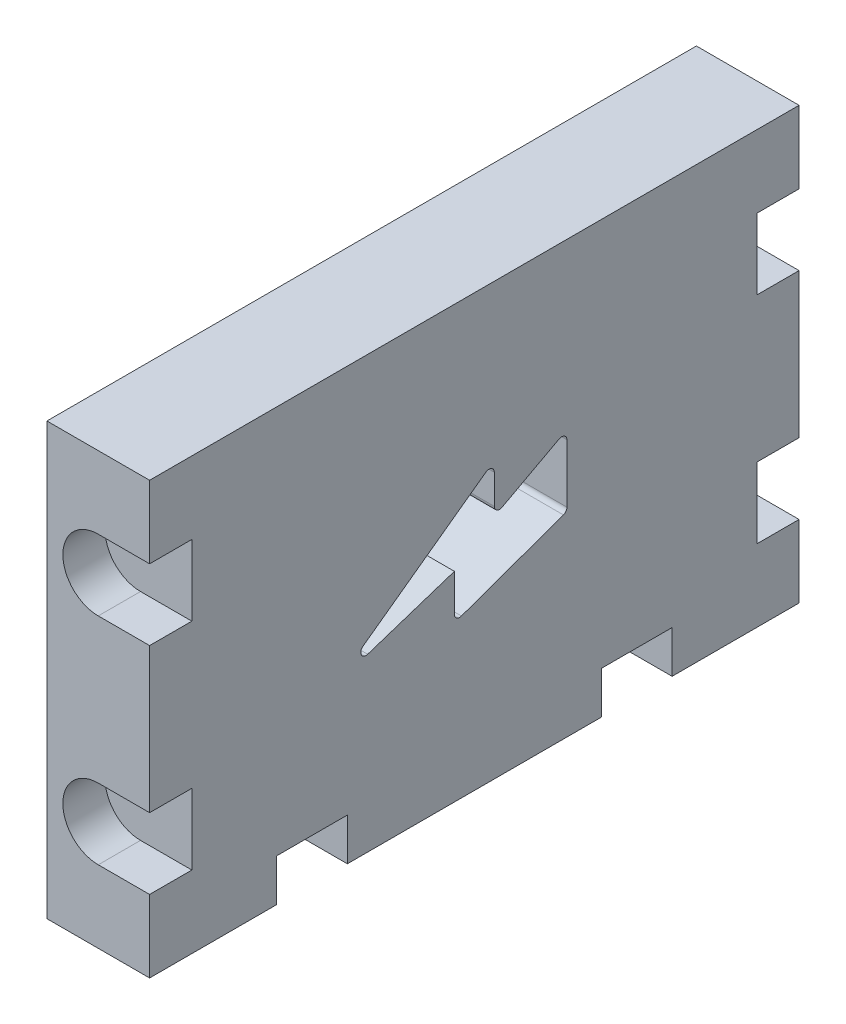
ISO-10303-21;
HEADER;
FILE_DESCRIPTION(('STEP AP214'),'2;1');
FILE_NAME('part.step','',(''),(''),'','','');
FILE_SCHEMA(('AUTOMOTIVE_DESIGN { 1 0 10303 214 1 1 1 1 }'));
ENDSEC;
DATA;
#1=APPLICATION_CONTEXT('core data for automotive mechanical design processes');
#2=APPLICATION_PROTOCOL_DEFINITION('international standard','automotive_design',2000,#1);
#3=PRODUCT_CONTEXT('',#1,'mechanical');
#4=PRODUCT('Part','Part','',(#3));
#5=PRODUCT_RELATED_PRODUCT_CATEGORY('part','',(#4));
#6=PRODUCT_DEFINITION_FORMATION('','',#4);
#7=PRODUCT_DEFINITION_CONTEXT('part definition',#1,'design');
#8=PRODUCT_DEFINITION('design','',#6,#7);
#9=PRODUCT_DEFINITION_SHAPE('','',#8);
#10=(LENGTH_UNIT() NAMED_UNIT(*) SI_UNIT(.MILLI.,.METRE.));
#11=(NAMED_UNIT(*) PLANE_ANGLE_UNIT() SI_UNIT($,.RADIAN.));
#12=(NAMED_UNIT(*) SI_UNIT($,.STERADIAN.) SOLID_ANGLE_UNIT());
#13=UNCERTAINTY_MEASURE_WITH_UNIT(LENGTH_MEASURE(1.E-05),#10,'distance_accuracy_value','');
#14=(GEOMETRIC_REPRESENTATION_CONTEXT(3) GLOBAL_UNCERTAINTY_ASSIGNED_CONTEXT((#13)) GLOBAL_UNIT_ASSIGNED_CONTEXT((#10,
#11,#12)) REPRESENTATION_CONTEXT('',''));
#15=CARTESIAN_POINT('',(0.,0.,0.));
#16=DIRECTION('',(0.,0.,1.));
#17=DIRECTION('',(1.,0.,0.));
#18=AXIS2_PLACEMENT_3D('',#15,#16,#17);
#19=CARTESIAN_POINT('',(-821.069349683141,484.071769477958,0.));
#20=DIRECTION('',(1.,0.,0.));
#21=DIRECTION('',(0.,0.,-1.));
#22=AXIS2_PLACEMENT_3D('',#19,#20,#21);
#23=PLANE('',#22);
#24=DIRECTION('',(0.,-1.,0.));
#25=VECTOR('',#24,1.);
#26=CARTESIAN_POINT('',(-821.069349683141,594.273586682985,-41.4368102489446));
#27=LINE('',#26,#25);
#28=CARTESIAN_POINT('',(-821.069349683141,593.027616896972,-41.4368102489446));
#29=VERTEX_POINT('',#28);
#30=CARTESIAN_POINT('',(-821.069349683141,589.475600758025,-41.4368102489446));
#31=VERTEX_POINT('',#30);
#32=EDGE_CURVE('E428',#29,#31,#27,.T.);
#33=ORIENTED_EDGE('',*,*,#32,.T.);
#34=CARTESIAN_POINT('',(-821.069349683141,589.475600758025,-42.0718102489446));
#35=DIRECTION('',(1.,0.,0.));
#36=DIRECTION('',(0.,0.,-1.));
#37=AXIS2_PLACEMENT_3D('',#34,#35,#36);
#38=CIRCLE('',#37,0.635);
#39=CARTESIAN_POINT('',(-821.069349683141,588.916063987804,-42.3720494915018));
#40=VERTEX_POINT('',#39);
#41=EDGE_CURVE('E501',#31,#40,#38,.T.);
#42=ORIENTED_EDGE('',*,*,#41,.T.);
#43=DIRECTION('',(0.,0.472817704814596,-0.881160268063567));
#44=VECTOR('',#43,1.);
#45=CARTESIAN_POINT('',(-821.069349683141,588.414228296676,-41.4368102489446));
#46=LINE('',#45,#44);
#47=CARTESIAN_POINT('',(-821.069349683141,592.599879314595,-49.2373416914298));
#48=VERTEX_POINT('',#47);
#49=EDGE_CURVE('E412',#40,#48,#46,.T.);
#50=ORIENTED_EDGE('',*,*,#49,.T.);
#51=CARTESIAN_POINT('',(-821.069349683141,592.040342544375,-49.5375809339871));
#52=DIRECTION('',(1.,0.,0.));
#53=DIRECTION('',(0.,0.,-1.));
#54=AXIS2_PLACEMENT_3D('',#51,#52,#53);
#55=CIRCLE('',#54,0.635);
#56=CARTESIAN_POINT('',(-821.069349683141,592.040342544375,-50.172580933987));
#57=VERTEX_POINT('',#56);
#58=EDGE_CURVE('E523',#48,#57,#55,.F.);
#59=ORIENTED_EDGE('',*,*,#58,.T.);
#60=DIRECTION('',(0.,-1.,0.));
#61=VECTOR('',#60,1.);
#62=CARTESIAN_POINT('',(-821.069349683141,593.101715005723,-50.172580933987));
#63=LINE('',#62,#61);
#64=CARTESIAN_POINT('',(-821.069349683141,585.026034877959,-50.172580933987));
#65=VERTEX_POINT('',#64);
#66=EDGE_CURVE('E415',#57,#65,#63,.T.);
#67=ORIENTED_EDGE('',*,*,#66,.T.);
#68=CARTESIAN_POINT('',(-821.069349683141,585.026034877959,-49.5375809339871));
#69=DIRECTION('',(1.,0.,0.));
#70=DIRECTION('',(0.,0.,-1.));
#71=AXIS2_PLACEMENT_3D('',#68,#69,#70);
#72=CIRCLE('',#71,0.635);
#73=CARTESIAN_POINT('',(-821.069349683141,584.42824204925,-49.7517508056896));
#74=VERTEX_POINT('',#73);
#75=EDGE_CURVE('E527',#65,#74,#72,.F.);
#76=ORIENTED_EDGE('',*,*,#75,.T.);
#77=DIRECTION('',(0.,-0.337275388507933,0.941406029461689));
#78=VECTOR('',#77,1.);
#79=CARTESIAN_POINT('',(-821.069349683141,584.579011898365,-50.172580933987));
#80=LINE('',#79,#78);
#81=CARTESIAN_POINT('',(-821.069349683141,580.03595465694,-37.4919596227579));
#82=VERTEX_POINT('',#81);
#83=EDGE_CURVE('E419',#74,#82,#80,.T.);
#84=ORIENTED_EDGE('',*,*,#83,.T.);
#85=CARTESIAN_POINT('',(-821.069349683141,580.633747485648,-37.2777897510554));
#86=DIRECTION('',(1.,0.,0.));
#87=DIRECTION('',(0.,0.,-1.));
#88=AXIS2_PLACEMENT_3D('',#85,#86,#87);
#89=CIRCLE('',#88,0.635);
#90=CARTESIAN_POINT('',(-821.069349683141,580.633747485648,-36.6427897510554));
#91=VERTEX_POINT('',#90);
#92=EDGE_CURVE('E114',#82,#91,#89,.F.);
#93=ORIENTED_EDGE('',*,*,#92,.T.);
#94=DIRECTION('',(0.,1.,0.));
#95=VECTOR('',#94,1.);
#96=CARTESIAN_POINT('',(-821.069349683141,579.731724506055,-36.6427897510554));
#97=LINE('',#96,#95);
#98=CARTESIAN_POINT('',(-821.069349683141,585.111680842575,-36.6427897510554));
#99=VERTEX_POINT('',#98);
#100=EDGE_CURVE('E421',#91,#99,#97,.T.);
#101=ORIENTED_EDGE('',*,*,#100,.T.);
#102=DIRECTION('',(0.,-0.31197044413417,0.950091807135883));
#103=VECTOR('',#102,1.);
#104=CARTESIAN_POINT('',(-821.069349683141,585.111680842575,-36.6427897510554));
#105=LINE('',#104,#103);
#106=CARTESIAN_POINT('',(-821.069349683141,581.688428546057,-26.217430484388));
#107=VERTEX_POINT('',#106);
#108=EDGE_CURVE('E423',#99,#107,#105,.T.);
#109=ORIENTED_EDGE('',*,*,#108,.T.);
#110=CARTESIAN_POINT('',(-821.069349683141,582.291736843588,-26.0193292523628));
#111=DIRECTION('',(1.,0.,0.));
#112=DIRECTION('',(0.,0.,-1.));
#113=AXIS2_PLACEMENT_3D('',#110,#111,#112);
#114=CIRCLE('',#113,0.635);
#115=CARTESIAN_POINT('',(-821.069349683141,582.805532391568,-25.6461816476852));
#116=VERTEX_POINT('',#115);
#117=EDGE_CURVE('E12',#107,#116,#114,.F.);
#118=ORIENTED_EDGE('',*,*,#117,.T.);
#119=DIRECTION('',(0.,0.587634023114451,-0.80912684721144));
#120=VECTOR('',#119,1.);
#121=CARTESIAN_POINT('',(-821.069349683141,580.424194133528,-22.3672620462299));
#122=LINE('',#121,#120);
#123=CARTESIAN_POINT('',(-821.069349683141,593.541412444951,-40.4286626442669));
#124=VERTEX_POINT('',#123);
#125=EDGE_CURVE('E425',#116,#124,#122,.T.);
#126=ORIENTED_EDGE('',*,*,#125,.T.);
#127=CARTESIAN_POINT('',(-821.069349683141,593.027616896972,-40.8018102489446));
#128=DIRECTION('',(1.,0.,0.));
#129=DIRECTION('',(0.,0.,-1.));
#130=AXIS2_PLACEMENT_3D('',#127,#128,#129);
#131=CIRCLE('',#130,0.635);
#132=EDGE_CURVE('E519',#124,#29,#131,.F.);
#133=ORIENTED_EDGE('',*,*,#132,.T.);
#134=EDGE_LOOP('',(#33,#42,#50,#59,#67,#76,#84,#93,#101,#109,#118,#126,#133));
#135=FACE_BOUND('',#134,.T.);
#136=DIRECTION('',(0.,-1.,0.));
#137=VECTOR('',#136,1.);
#138=CARTESIAN_POINT('',(-821.069349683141,484.071769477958,0.));
#139=LINE('',#138,#137);
#140=CARTESIAN_POINT('',(-821.069349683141,612.913454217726,0.));
#141=VERTEX_POINT('',#140);
#142=CARTESIAN_POINT('',(-821.069349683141,604.212554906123,0.));
#143=VERTEX_POINT('',#142);
#144=EDGE_CURVE('E481',#141,#143,#139,.T.);
#145=ORIENTED_EDGE('',*,*,#144,.T.);
#146=DIRECTION('',(0.,0.,1.));
#147=VECTOR('',#146,1.);
#148=CARTESIAN_POINT('',(-821.069349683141,604.212554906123,-15.5918568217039));
#149=LINE('',#148,#147);
#150=CARTESIAN_POINT('',(-821.069349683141,604.212554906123,-5.08));
#151=VERTEX_POINT('',#150);
#152=EDGE_CURVE('E361',#151,#143,#149,.T.);
#153=ORIENTED_EDGE('',*,*,#152,.F.);
#154=DIRECTION('',(0.,-1.,0.));
#155=VECTOR('',#154,1.);
#156=CARTESIAN_POINT('',(-821.069349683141,0.,-5.08));
#157=LINE('',#156,#155);
#158=CARTESIAN_POINT('',(-821.069349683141,595.703554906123,-5.08));
#159=VERTEX_POINT('',#158);
#160=EDGE_CURVE('E1234',#151,#159,#157,.T.);
#161=ORIENTED_EDGE('',*,*,#160,.T.);
#162=DIRECTION('',(0.,0.,1.));
#163=VECTOR('',#162,1.);
#164=CARTESIAN_POINT('',(-821.069349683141,595.703554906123,-15.5918568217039));
#165=LINE('',#164,#163);
#166=CARTESIAN_POINT('',(-821.069349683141,595.703554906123,0.));
#167=VERTEX_POINT('',#166);
#168=EDGE_CURVE('E1221',#159,#167,#165,.T.);
#169=ORIENTED_EDGE('',*,*,#168,.T.);
#170=CARTESIAN_POINT('',(-821.069349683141,578.301756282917,0.));
#171=VERTEX_POINT('',#170);
#172=EDGE_CURVE('E484',#167,#171,#139,.T.);
#173=ORIENTED_EDGE('',*,*,#172,.T.);
#174=DIRECTION('',(0.,0.,1.));
#175=VECTOR('',#174,1.);
#176=CARTESIAN_POINT('',(-821.069349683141,578.301756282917,-15.5918568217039));
#177=LINE('',#176,#175);
#178=CARTESIAN_POINT('',(-821.069349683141,578.301756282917,-5.08));
#179=VERTEX_POINT('',#178);
#180=EDGE_CURVE('E1140',#179,#171,#177,.T.);
#181=ORIENTED_EDGE('',*,*,#180,.F.);
#182=DIRECTION('',(0.,-1.,0.));
#183=VECTOR('',#182,1.);
#184=CARTESIAN_POINT('',(-821.069349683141,0.,-5.08));
#185=LINE('',#184,#183);
#186=CARTESIAN_POINT('',(-821.069349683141,569.792756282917,-5.08));
#187=VERTEX_POINT('',#186);
#188=EDGE_CURVE('E1222',#179,#187,#185,.T.);
#189=ORIENTED_EDGE('',*,*,#188,.T.);
#190=DIRECTION('',(0.,0.,1.));
#191=VECTOR('',#190,1.);
#192=CARTESIAN_POINT('',(-821.069349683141,569.792756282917,-15.5918568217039));
#193=LINE('',#192,#191);
#194=CARTESIAN_POINT('',(-821.069349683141,569.792756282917,0.));
#195=VERTEX_POINT('',#194);
#196=EDGE_CURVE('E1136',#187,#195,#193,.T.);
#197=ORIENTED_EDGE('',*,*,#196,.T.);
#198=CARTESIAN_POINT('',(-821.069349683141,561.091856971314,0.));
#199=VERTEX_POINT('',#198);
#200=EDGE_CURVE('E479',#195,#199,#139,.T.);
#201=ORIENTED_EDGE('',*,*,#200,.T.);
#202=DIRECTION('',(0.,0.,1.));
#203=VECTOR('',#202,1.);
#204=CARTESIAN_POINT('',(-821.069349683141,561.091856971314,0.));
#205=LINE('',#204,#203);
#206=CARTESIAN_POINT('',(-821.069349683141,561.091856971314,-15.2653999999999));
#207=VERTEX_POINT('',#206);
#208=EDGE_CURVE('E456',#207,#199,#205,.T.);
#209=ORIENTED_EDGE('',*,*,#208,.F.);
#210=DIRECTION('',(0.,-1.,0.));
#211=VECTOR('',#210,1.);
#212=CARTESIAN_POINT('',(-821.069349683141,576.683713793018,-15.2653999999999));
#213=LINE('',#212,#211);
#214=CARTESIAN_POINT('',(-821.069349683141,566.171856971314,-15.2653999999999));
#215=VERTEX_POINT('',#214);
#216=EDGE_CURVE('E1151',#215,#207,#213,.T.);
#217=ORIENTED_EDGE('',*,*,#216,.F.);
#218=DIRECTION('',(0.,0.,-1.));
#219=VECTOR('',#218,1.);
#220=CARTESIAN_POINT('',(-821.069349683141,566.171856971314,0.));
#221=LINE('',#220,#219);
#222=CARTESIAN_POINT('',(-821.069349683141,566.171856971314,-23.7744000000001));
#223=VERTEX_POINT('',#222);
#224=EDGE_CURVE('E1150',#215,#223,#221,.T.);
#225=ORIENTED_EDGE('',*,*,#224,.T.);
#226=DIRECTION('',(0.,-1.,0.));
#227=VECTOR('',#226,1.);
#228=CARTESIAN_POINT('',(-821.069349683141,576.683713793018,-23.7744000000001));
#229=LINE('',#228,#227);
#230=CARTESIAN_POINT('',(-821.069349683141,561.091856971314,-23.7744000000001));
#231=VERTEX_POINT('',#230);
#232=EDGE_CURVE('E1164',#223,#231,#229,.T.);
#233=ORIENTED_EDGE('',*,*,#232,.T.);
#234=CARTESIAN_POINT('',(-821.069349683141,561.091856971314,-54.3051999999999));
#235=VERTEX_POINT('',#234);
#236=EDGE_CURVE('E461',#235,#231,#205,.T.);
#237=ORIENTED_EDGE('',*,*,#236,.F.);
#238=DIRECTION('',(0.,-1.,0.));
#239=VECTOR('',#238,1.);
#240=CARTESIAN_POINT('',(-821.069349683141,576.683713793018,-54.3051999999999));
#241=LINE('',#240,#239);
#242=CARTESIAN_POINT('',(-821.069349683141,566.171856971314,-54.3051999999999));
#243=VERTEX_POINT('',#242);
#244=EDGE_CURVE('E1174',#243,#235,#241,.T.);
#245=ORIENTED_EDGE('',*,*,#244,.F.);
#246=DIRECTION('',(0.,0.,-1.));
#247=VECTOR('',#246,1.);
#248=CARTESIAN_POINT('',(-821.069349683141,566.171856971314,0.));
#249=LINE('',#248,#247);
#250=CARTESIAN_POINT('',(-821.069349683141,566.171856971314,-62.8142000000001));
#251=VERTEX_POINT('',#250);
#252=EDGE_CURVE('E1173',#243,#251,#249,.T.);
#253=ORIENTED_EDGE('',*,*,#252,.T.);
#254=DIRECTION('',(0.,-1.,0.));
#255=VECTOR('',#254,1.);
#256=CARTESIAN_POINT('',(-821.069349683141,576.683713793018,-62.8142000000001));
#257=LINE('',#256,#255);
#258=CARTESIAN_POINT('',(-821.069349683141,561.091856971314,-62.8142000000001));
#259=VERTEX_POINT('',#258);
#260=EDGE_CURVE('E1187',#251,#259,#257,.T.);
#261=ORIENTED_EDGE('',*,*,#260,.T.);
#262=CARTESIAN_POINT('',(-821.069349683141,561.091856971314,-78.0796));
#263=VERTEX_POINT('',#262);
#264=EDGE_CURVE('E457',#263,#259,#205,.T.);
#265=ORIENTED_EDGE('',*,*,#264,.F.);
#266=DIRECTION('',(0.,1.,0.));
#267=VECTOR('',#266,1.);
#268=CARTESIAN_POINT('',(-821.069349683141,484.071769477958,-78.0796));
#269=LINE('',#268,#267);
#270=CARTESIAN_POINT('',(-821.069349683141,569.792756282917,-78.0796));
#271=VERTEX_POINT('',#270);
#272=EDGE_CURVE('E476',#263,#271,#269,.T.);
#273=ORIENTED_EDGE('',*,*,#272,.T.);
#274=DIRECTION('',(0.,0.,-1.));
#275=VECTOR('',#274,1.);
#276=CARTESIAN_POINT('',(-821.069349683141,569.792756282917,-62.4877431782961));
#277=LINE('',#276,#275);
#278=CARTESIAN_POINT('',(-821.069349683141,569.792756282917,-72.9996));
#279=VERTEX_POINT('',#278);
#280=EDGE_CURVE('E1109',#279,#271,#277,.T.);
#281=ORIENTED_EDGE('',*,*,#280,.F.);
#282=DIRECTION('',(0.,1.,0.));
#283=VECTOR('',#282,1.);
#284=CARTESIAN_POINT('',(-821.069349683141,0.,-72.9996));
#285=LINE('',#284,#283);
#286=CARTESIAN_POINT('',(-821.069349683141,578.301756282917,-72.9996));
#287=VERTEX_POINT('',#286);
#288=EDGE_CURVE('E1095',#279,#287,#285,.T.);
#289=ORIENTED_EDGE('',*,*,#288,.T.);
#290=DIRECTION('',(0.,0.,-1.));
#291=VECTOR('',#290,1.);
#292=CARTESIAN_POINT('',(-821.069349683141,578.301756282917,-62.4877431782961));
#293=LINE('',#292,#291);
#294=CARTESIAN_POINT('',(-821.069349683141,578.301756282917,-78.0796));
#295=VERTEX_POINT('',#294);
#296=EDGE_CURVE('E1070',#287,#295,#293,.T.);
#297=ORIENTED_EDGE('',*,*,#296,.T.);
#298=CARTESIAN_POINT('',(-821.069349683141,595.703554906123,-78.0796));
#299=VERTEX_POINT('',#298);
#300=EDGE_CURVE('E480',#295,#299,#269,.T.);
#301=ORIENTED_EDGE('',*,*,#300,.T.);
#302=DIRECTION('',(0.,0.,-1.));
#303=VECTOR('',#302,1.);
#304=CARTESIAN_POINT('',(-821.069349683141,595.703554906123,-62.4877431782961));
#305=LINE('',#304,#303);
#306=CARTESIAN_POINT('',(-821.069349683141,595.703554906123,-72.9996));
#307=VERTEX_POINT('',#306);
#308=EDGE_CURVE('E1068',#307,#299,#305,.T.);
#309=ORIENTED_EDGE('',*,*,#308,.F.);
#310=DIRECTION('',(0.,1.,0.));
#311=VECTOR('',#310,1.);
#312=CARTESIAN_POINT('',(-821.069349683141,0.,-72.9996));
#313=LINE('',#312,#311);
#314=CARTESIAN_POINT('',(-821.069349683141,604.212554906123,-72.9996));
#315=VERTEX_POINT('',#314);
#316=EDGE_CURVE('E1088',#307,#315,#313,.T.);
#317=ORIENTED_EDGE('',*,*,#316,.T.);
#318=DIRECTION('',(0.,0.,-1.));
#319=VECTOR('',#318,1.);
#320=CARTESIAN_POINT('',(-821.069349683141,604.212554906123,-62.4877431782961));
#321=LINE('',#320,#319);
#322=CARTESIAN_POINT('',(-821.069349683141,604.212554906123,-78.0796));
#323=VERTEX_POINT('',#322);
#324=EDGE_CURVE('E1062',#315,#323,#321,.T.);
#325=ORIENTED_EDGE('',*,*,#324,.T.);
#326=CARTESIAN_POINT('',(-821.069349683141,612.913454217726,-78.0796));
#327=VERTEX_POINT('',#326);
#328=EDGE_CURVE('E475',#323,#327,#269,.T.);
#329=ORIENTED_EDGE('',*,*,#328,.T.);
#330=DIRECTION('',(0.,0.,-1.));
#331=VECTOR('',#330,1.);
#332=CARTESIAN_POINT('',(-821.069349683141,612.913454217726,0.));
#333=LINE('',#332,#331);
#334=EDGE_CURVE('E472',#141,#327,#333,.T.);
#335=ORIENTED_EDGE('',*,*,#334,.F.);
#336=EDGE_LOOP('',(#145,#153,#161,#169,#173,#181,#189,#197,#201,#209,#217,#225,#233,#237,#245,
#253,#261,#265,#273,#281,#289,#297,#301,#309,#317,#325,#329,#335));
#337=FACE_BOUND('',#336,.T.);
#338=ADVANCED_FACE('F91',(#135,#337),#23,.T.);
#339=CARTESIAN_POINT('',(0.,0.,0.));
#340=DIRECTION('',(0.,0.,1.));
#341=DIRECTION('',(1.,0.,0.));
#342=AXIS2_PLACEMENT_3D('',#339,#340,#341);
#343=PLANE('',#342);
#344=CARTESIAN_POINT('',(-827.241549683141,599.958054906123,0.));
#345=DIRECTION('',(0.,0.,1.));
#346=DIRECTION('',(1.,0.,0.));
#347=AXIS2_PLACEMENT_3D('',#344,#345,#346);
#348=CIRCLE('',#347,4.25450000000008);
#349=CARTESIAN_POINT('',(-827.241549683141,604.212554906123,0.));
#350=VERTEX_POINT('',#349);
#351=CARTESIAN_POINT('',(-827.241549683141,595.703554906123,0.));
#352=VERTEX_POINT('',#351);
#353=EDGE_CURVE('E373',#350,#352,#348,.T.);
#354=ORIENTED_EDGE('',*,*,#353,.F.);
#355=DIRECTION('',(1.,0.,0.));
#356=VECTOR('',#355,1.);
#357=CARTESIAN_POINT('',(0.,604.212554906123,0.));
#358=LINE('',#357,#356);
#359=EDGE_CURVE('E355',#350,#143,#358,.T.);
#360=ORIENTED_EDGE('',*,*,#359,.T.);
#361=ORIENTED_EDGE('',*,*,#144,.F.);
#362=DIRECTION('',(1.,0.,0.));
#363=VECTOR('',#362,1.);
#364=CARTESIAN_POINT('',(0.,612.913454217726,0.));
#365=LINE('',#364,#363);
#366=CARTESIAN_POINT('',(-833.413749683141,612.913454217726,0.));
#367=VERTEX_POINT('',#366);
#368=EDGE_CURVE('E462',#367,#141,#365,.T.);
#369=ORIENTED_EDGE('',*,*,#368,.F.);
#370=DIRECTION('',(0.,1.,0.));
#371=VECTOR('',#370,1.);
#372=CARTESIAN_POINT('',(-833.413749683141,0.,0.));
#373=LINE('',#372,#371);
#374=CARTESIAN_POINT('',(-833.413749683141,561.091856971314,0.));
#375=VERTEX_POINT('',#374);
#376=EDGE_CURVE('E406',#375,#367,#373,.T.);
#377=ORIENTED_EDGE('',*,*,#376,.F.);
#378=DIRECTION('',(1.,0.,0.));
#379=VECTOR('',#378,1.);
#380=CARTESIAN_POINT('',(-899.286453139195,561.091856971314,0.));
#381=LINE('',#380,#379);
#382=EDGE_CURVE('E453',#375,#199,#381,.T.);
#383=ORIENTED_EDGE('',*,*,#382,.T.);
#384=ORIENTED_EDGE('',*,*,#200,.F.);
#385=DIRECTION('',(1.,0.,0.));
#386=VECTOR('',#385,1.);
#387=CARTESIAN_POINT('',(0.,569.792756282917,0.));
#388=LINE('',#387,#386);
#389=CARTESIAN_POINT('',(-827.241549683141,569.792756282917,0.));
#390=VERTEX_POINT('',#389);
#391=EDGE_CURVE('E1143',#390,#195,#388,.T.);
#392=ORIENTED_EDGE('',*,*,#391,.F.);
#393=CARTESIAN_POINT('',(-827.241549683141,574.047256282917,0.));
#394=DIRECTION('',(0.,0.,1.));
#395=DIRECTION('',(1.,0.,0.));
#396=AXIS2_PLACEMENT_3D('',#393,#394,#395);
#397=CIRCLE('',#396,4.25450000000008);
#398=CARTESIAN_POINT('',(-827.241549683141,578.301756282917,0.));
#399=VERTEX_POINT('',#398);
#400=EDGE_CURVE('E381',#399,#390,#397,.T.);
#401=ORIENTED_EDGE('',*,*,#400,.F.);
#402=DIRECTION('',(1.,0.,0.));
#403=VECTOR('',#402,1.);
#404=CARTESIAN_POINT('',(0.,578.301756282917,0.));
#405=LINE('',#404,#403);
#406=EDGE_CURVE('E1137',#399,#171,#405,.T.);
#407=ORIENTED_EDGE('',*,*,#406,.T.);
#408=ORIENTED_EDGE('',*,*,#172,.F.);
#409=DIRECTION('',(1.,0.,0.));
#410=VECTOR('',#409,1.);
#411=CARTESIAN_POINT('',(0.,595.703554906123,0.));
#412=LINE('',#411,#410);
#413=EDGE_CURVE('E365',#352,#167,#412,.T.);
#414=ORIENTED_EDGE('',*,*,#413,.F.);
#415=EDGE_LOOP('',(#354,#360,#361,#369,#377,#383,#384,#392,#401,#407,#408,#414));
#416=FACE_BOUND('',#415,.T.);
#417=ADVANCED_FACE('F379',(#416),#343,.T.);
#418=CARTESIAN_POINT('',(-827.241549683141,599.958054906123,-5.08));
#419=DIRECTION('',(0.,0.,1.));
#420=DIRECTION('',(1.,0.,0.));
#421=AXIS2_PLACEMENT_3D('',#418,#419,#420);
#422=CYLINDRICAL_SURFACE('',#421,4.25450000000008);
#423=DIRECTION('',(0.,0.,1.));
#424=VECTOR('',#423,1.);
#425=CARTESIAN_POINT('',(-827.241549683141,604.212554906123,-15.5918568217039));
#426=LINE('',#425,#424);
#427=CARTESIAN_POINT('',(-827.241549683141,604.212554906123,-5.08));
#428=VERTEX_POINT('',#427);
#429=EDGE_CURVE('E358',#428,#350,#426,.T.);
#430=ORIENTED_EDGE('',*,*,#429,.T.);
#431=ORIENTED_EDGE('',*,*,#353,.T.);
#432=DIRECTION('',(0.,0.,1.));
#433=VECTOR('',#432,1.);
#434=CARTESIAN_POINT('',(-827.241549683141,595.703554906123,-15.5918568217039));
#435=LINE('',#434,#433);
#436=CARTESIAN_POINT('',(-827.241549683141,595.703554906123,-5.08));
#437=VERTEX_POINT('',#436);
#438=EDGE_CURVE('E376',#437,#352,#435,.T.);
#439=ORIENTED_EDGE('',*,*,#438,.F.);
#440=CARTESIAN_POINT('',(-827.241549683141,599.958054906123,-5.08));
#441=DIRECTION('',(0.,0.,1.));
#442=DIRECTION('',(1.,0.,0.));
#443=AXIS2_PLACEMENT_3D('',#440,#441,#442);
#444=CIRCLE('',#443,4.25450000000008);
#445=EDGE_CURVE('E375',#428,#437,#444,.T.);
#446=ORIENTED_EDGE('',*,*,#445,.F.);
#447=EDGE_LOOP('',(#430,#431,#439,#446));
#448=FACE_BOUND('',#447,.T.);
#449=ADVANCED_FACE('F371',(#448),#422,.F.);
#450=CARTESIAN_POINT('',(-827.241549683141,574.047256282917,-5.08));
#451=DIRECTION('',(0.,0.,1.));
#452=DIRECTION('',(1.,0.,0.));
#453=AXIS2_PLACEMENT_3D('',#450,#451,#452);
#454=CYLINDRICAL_SURFACE('',#453,4.25450000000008);
#455=DIRECTION('',(0.,0.,1.));
#456=VECTOR('',#455,1.);
#457=CARTESIAN_POINT('',(-827.241549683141,578.301756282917,-15.5918568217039));
#458=LINE('',#457,#456);
#459=CARTESIAN_POINT('',(-827.241549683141,578.301756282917,-5.08));
#460=VERTEX_POINT('',#459);
#461=EDGE_CURVE('E1132',#460,#399,#458,.T.);
#462=ORIENTED_EDGE('',*,*,#461,.T.);
#463=ORIENTED_EDGE('',*,*,#400,.T.);
#464=DIRECTION('',(0.,0.,1.));
#465=VECTOR('',#464,1.);
#466=CARTESIAN_POINT('',(-827.241549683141,569.792756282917,-15.5918568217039));
#467=LINE('',#466,#465);
#468=CARTESIAN_POINT('',(-827.241549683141,569.792756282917,-5.08));
#469=VERTEX_POINT('',#468);
#470=EDGE_CURVE('E1134',#469,#390,#467,.T.);
#471=ORIENTED_EDGE('',*,*,#470,.F.);
#472=CARTESIAN_POINT('',(-827.241549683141,574.047256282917,-5.08));
#473=DIRECTION('',(0.,0.,1.));
#474=DIRECTION('',(1.,0.,0.));
#475=AXIS2_PLACEMENT_3D('',#472,#473,#474);
#476=CIRCLE('',#475,4.25450000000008);
#477=EDGE_CURVE('E384',#460,#469,#476,.T.);
#478=ORIENTED_EDGE('',*,*,#477,.F.);
#479=EDGE_LOOP('',(#462,#463,#471,#478));
#480=FACE_BOUND('',#479,.T.);
#481=ADVANCED_FACE('F758',(#480),#454,.F.);
#482=CARTESIAN_POINT('',(-899.286453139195,561.091856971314,0.));
#483=DIRECTION('',(0.,1.,0.));
#484=DIRECTION('',(0.,0.,1.));
#485=AXIS2_PLACEMENT_3D('',#482,#483,#484);
#486=PLANE('',#485);
#487=DIRECTION('',(1.,0.,0.));
#488=VECTOR('',#487,1.);
#489=CARTESIAN_POINT('',(0.,561.091856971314,-15.2653999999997));
#490=LINE('',#489,#488);
#491=CARTESIAN_POINT('',(-827.241549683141,561.091856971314,-15.2653999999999));
#492=VERTEX_POINT('',#491);
#493=EDGE_CURVE('E1156',#492,#207,#490,.T.);
#494=ORIENTED_EDGE('',*,*,#493,.T.);
#495=ORIENTED_EDGE('',*,*,#208,.T.);
#496=ORIENTED_EDGE('',*,*,#382,.F.);
#497=DIRECTION('',(0.,0.,-1.));
#498=VECTOR('',#497,1.);
#499=CARTESIAN_POINT('',(-833.413749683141,561.091856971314,0.));
#500=LINE('',#499,#498);
#501=CARTESIAN_POINT('',(-833.413749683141,561.091856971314,-78.0796));
#502=VERTEX_POINT('',#501);
#503=EDGE_CURVE('E393',#375,#502,#500,.T.);
#504=ORIENTED_EDGE('',*,*,#503,.T.);
#505=DIRECTION('',(-1.,0.,0.));
#506=VECTOR('',#505,1.);
#507=CARTESIAN_POINT('',(-899.286453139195,561.091856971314,-78.0796));
#508=LINE('',#507,#506);
#509=EDGE_CURVE('E451',#263,#502,#508,.T.);
#510=ORIENTED_EDGE('',*,*,#509,.F.);
#511=ORIENTED_EDGE('',*,*,#264,.T.);
#512=DIRECTION('',(1.,0.,0.));
#513=VECTOR('',#512,1.);
#514=CARTESIAN_POINT('',(0.,561.091856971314,-62.8142000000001));
#515=LINE('',#514,#513);
#516=CARTESIAN_POINT('',(-827.241549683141,561.091856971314,-62.8142000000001));
#517=VERTEX_POINT('',#516);
#518=EDGE_CURVE('E1182',#517,#259,#515,.T.);
#519=ORIENTED_EDGE('',*,*,#518,.F.);
#520=CARTESIAN_POINT('',(-827.241549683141,561.091856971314,-58.5597));
#521=DIRECTION('',(0.,-1.,0.));
#522=DIRECTION('',(0.,0.,-1.));
#523=AXIS2_PLACEMENT_3D('',#520,#521,#522);
#524=CIRCLE('',#523,4.25450000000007);
#525=CARTESIAN_POINT('',(-827.241549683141,561.091856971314,-54.3051999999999));
#526=VERTEX_POINT('',#525);
#527=EDGE_CURVE('E1119',#526,#517,#524,.T.);
#528=ORIENTED_EDGE('',*,*,#527,.F.);
#529=DIRECTION('',(1.,0.,0.));
#530=VECTOR('',#529,1.);
#531=CARTESIAN_POINT('',(0.,561.091856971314,-54.3051999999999));
#532=LINE('',#531,#530);
#533=EDGE_CURVE('E1179',#526,#235,#532,.T.);
#534=ORIENTED_EDGE('',*,*,#533,.T.);
#535=ORIENTED_EDGE('',*,*,#236,.T.);
#536=DIRECTION('',(1.,0.,0.));
#537=VECTOR('',#536,1.);
#538=CARTESIAN_POINT('',(0.,561.091856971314,-23.7744000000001));
#539=LINE('',#538,#537);
#540=CARTESIAN_POINT('',(-827.241549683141,561.091856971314,-23.7744000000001));
#541=VERTEX_POINT('',#540);
#542=EDGE_CURVE('E1159',#541,#231,#539,.T.);
#543=ORIENTED_EDGE('',*,*,#542,.F.);
#544=CARTESIAN_POINT('',(-827.241549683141,561.091856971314,-19.5199));
#545=DIRECTION('',(0.,-1.,0.));
#546=DIRECTION('',(0.,0.,-1.));
#547=AXIS2_PLACEMENT_3D('',#544,#545,#546);
#548=CIRCLE('',#547,4.25450000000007);
#549=EDGE_CURVE('E1116',#492,#541,#548,.T.);
#550=ORIENTED_EDGE('',*,*,#549,.F.);
#551=EDGE_LOOP('',(#494,#495,#496,#504,#510,#511,#519,#528,#534,#535,#543,#550));
#552=FACE_BOUND('',#551,.T.);
#553=ADVANCED_FACE('F767',(#552),#486,.F.);
#554=CARTESIAN_POINT('',(-827.241549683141,566.171856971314,-58.5597));
#555=DIRECTION('',(0.,-1.,0.));
#556=DIRECTION('',(0.,0.,-1.));
#557=AXIS2_PLACEMENT_3D('',#554,#555,#556);
#558=CYLINDRICAL_SURFACE('',#557,4.25450000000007);
#559=DIRECTION('',(0.,-1.,0.));
#560=VECTOR('',#559,1.);
#561=CARTESIAN_POINT('',(-827.241549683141,576.683713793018,-54.3051999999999));
#562=LINE('',#561,#560);
#563=CARTESIAN_POINT('',(-827.241549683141,566.171856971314,-54.3051999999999));
#564=VERTEX_POINT('',#563);
#565=EDGE_CURVE('E1185',#564,#526,#562,.T.);
#566=ORIENTED_EDGE('',*,*,#565,.T.);
#567=ORIENTED_EDGE('',*,*,#527,.T.);
#568=DIRECTION('',(0.,-1.,0.));
#569=VECTOR('',#568,1.);
#570=CARTESIAN_POINT('',(-827.241549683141,576.683713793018,-62.8142000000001));
#571=LINE('',#570,#569);
#572=CARTESIAN_POINT('',(-827.241549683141,566.171856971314,-62.8142000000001));
#573=VERTEX_POINT('',#572);
#574=EDGE_CURVE('E1190',#573,#517,#571,.T.);
#575=ORIENTED_EDGE('',*,*,#574,.F.);
#576=CARTESIAN_POINT('',(-827.241549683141,566.171856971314,-58.5597));
#577=DIRECTION('',(0.,-1.,0.));
#578=DIRECTION('',(0.,0.,-1.));
#579=AXIS2_PLACEMENT_3D('',#576,#577,#578);
#580=CIRCLE('',#579,4.25450000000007);
#581=EDGE_CURVE('E1093',#564,#573,#580,.T.);
#582=ORIENTED_EDGE('',*,*,#581,.F.);
#583=EDGE_LOOP('',(#566,#567,#575,#582));
#584=FACE_BOUND('',#583,.T.);
#585=ADVANCED_FACE('F813',(#584),#558,.F.);
#586=CARTESIAN_POINT('',(-827.241549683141,566.171856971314,-19.5199));
#587=DIRECTION('',(0.,-1.,0.));
#588=DIRECTION('',(0.,0.,-1.));
#589=AXIS2_PLACEMENT_3D('',#586,#587,#588);
#590=CYLINDRICAL_SURFACE('',#589,4.25450000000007);
#591=DIRECTION('',(0.,-1.,0.));
#592=VECTOR('',#591,1.);
#593=CARTESIAN_POINT('',(-827.241549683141,576.683713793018,-15.2653999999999));
#594=LINE('',#593,#592);
#595=CARTESIAN_POINT('',(-827.241549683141,566.171856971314,-15.2653999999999));
#596=VERTEX_POINT('',#595);
#597=EDGE_CURVE('E1162',#596,#492,#594,.T.);
#598=ORIENTED_EDGE('',*,*,#597,.T.);
#599=ORIENTED_EDGE('',*,*,#549,.T.);
#600=DIRECTION('',(0.,-1.,0.));
#601=VECTOR('',#600,1.);
#602=CARTESIAN_POINT('',(-827.241549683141,576.683713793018,-23.7744000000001));
#603=LINE('',#602,#601);
#604=CARTESIAN_POINT('',(-827.241549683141,566.171856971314,-23.7744000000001));
#605=VERTEX_POINT('',#604);
#606=EDGE_CURVE('E1167',#605,#541,#603,.T.);
#607=ORIENTED_EDGE('',*,*,#606,.F.);
#608=CARTESIAN_POINT('',(-827.241549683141,566.171856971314,-19.5199));
#609=DIRECTION('',(0.,-1.,0.));
#610=DIRECTION('',(0.,0.,-1.));
#611=AXIS2_PLACEMENT_3D('',#608,#609,#610);
#612=CIRCLE('',#611,4.25450000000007);
#613=EDGE_CURVE('E386',#596,#605,#612,.T.);
#614=ORIENTED_EDGE('',*,*,#613,.F.);
#615=EDGE_LOOP('',(#598,#599,#607,#614));
#616=FACE_BOUND('',#615,.T.);
#617=ADVANCED_FACE('F823',(#616),#590,.F.);
#618=CARTESIAN_POINT('',(0.,0.,-78.0796));
#619=DIRECTION('',(0.,0.,-1.));
#620=DIRECTION('',(-1.,0.,0.));
#621=AXIS2_PLACEMENT_3D('',#618,#619,#620);
#622=PLANE('',#621);
#623=CARTESIAN_POINT('',(-827.241549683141,599.958054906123,-78.0796));
#624=DIRECTION('',(0.,0.,-1.));
#625=DIRECTION('',(-1.,0.,0.));
#626=AXIS2_PLACEMENT_3D('',#623,#624,#625);
#627=CIRCLE('',#626,4.25450000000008);
#628=CARTESIAN_POINT('',(-827.241549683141,595.703554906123,-78.0796));
#629=VERTEX_POINT('',#628);
#630=CARTESIAN_POINT('',(-827.241549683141,604.212554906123,-78.0796));
#631=VERTEX_POINT('',#630);
#632=EDGE_CURVE('E394',#629,#631,#627,.T.);
#633=ORIENTED_EDGE('',*,*,#632,.F.);
#634=DIRECTION('',(1.,0.,0.));
#635=VECTOR('',#634,1.);
#636=CARTESIAN_POINT('',(0.,595.703554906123,-78.0796));
#637=LINE('',#636,#635);
#638=EDGE_CURVE('E1076',#629,#299,#637,.T.);
#639=ORIENTED_EDGE('',*,*,#638,.T.);
#640=ORIENTED_EDGE('',*,*,#300,.F.);
#641=DIRECTION('',(1.,0.,0.));
#642=VECTOR('',#641,1.);
#643=CARTESIAN_POINT('',(0.,578.301756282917,-78.0796));
#644=LINE('',#643,#642);
#645=CARTESIAN_POINT('',(-827.241549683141,578.301756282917,-78.0796));
#646=VERTEX_POINT('',#645);
#647=EDGE_CURVE('E1075',#646,#295,#644,.T.);
#648=ORIENTED_EDGE('',*,*,#647,.F.);
#649=CARTESIAN_POINT('',(-827.241549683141,574.047256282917,-78.0796));
#650=DIRECTION('',(0.,0.,-1.));
#651=DIRECTION('',(-1.,0.,0.));
#652=AXIS2_PLACEMENT_3D('',#649,#650,#651);
#653=CIRCLE('',#652,4.25450000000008);
#654=CARTESIAN_POINT('',(-827.241549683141,569.792756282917,-78.0796));
#655=VERTEX_POINT('',#654);
#656=EDGE_CURVE('E397',#655,#646,#653,.T.);
#657=ORIENTED_EDGE('',*,*,#656,.F.);
#658=DIRECTION('',(1.,0.,0.));
#659=VECTOR('',#658,1.);
#660=CARTESIAN_POINT('',(0.,569.792756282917,-78.0796));
#661=LINE('',#660,#659);
#662=EDGE_CURVE('E1102',#655,#271,#661,.T.);
#663=ORIENTED_EDGE('',*,*,#662,.T.);
#664=ORIENTED_EDGE('',*,*,#272,.F.);
#665=ORIENTED_EDGE('',*,*,#509,.T.);
#666=DIRECTION('',(0.,-1.,0.));
#667=VECTOR('',#666,1.);
#668=CARTESIAN_POINT('',(-833.413749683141,0.,-78.0796));
#669=LINE('',#668,#667);
#670=CARTESIAN_POINT('',(-833.413749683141,612.913454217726,-78.0796));
#671=VERTEX_POINT('',#670);
#672=EDGE_CURVE('E405',#671,#502,#669,.T.);
#673=ORIENTED_EDGE('',*,*,#672,.F.);
#674=DIRECTION('',(1.,0.,0.));
#675=VECTOR('',#674,1.);
#676=CARTESIAN_POINT('',(-820.002549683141,612.913454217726,-78.0796));
#677=LINE('',#676,#675);
#678=EDGE_CURVE('E460',#671,#327,#677,.T.);
#679=ORIENTED_EDGE('',*,*,#678,.T.);
#680=ORIENTED_EDGE('',*,*,#328,.F.);
#681=DIRECTION('',(1.,0.,0.));
#682=VECTOR('',#681,1.);
#683=CARTESIAN_POINT('',(0.,604.212554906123,-78.0796));
#684=LINE('',#683,#682);
#685=EDGE_CURVE('E1079',#631,#323,#684,.T.);
#686=ORIENTED_EDGE('',*,*,#685,.F.);
#687=EDGE_LOOP('',(#633,#639,#640,#648,#657,#663,#664,#665,#673,#679,#680,#686));
#688=FACE_BOUND('',#687,.T.);
#689=ADVANCED_FACE('F833',(#688),#622,.T.);
#690=CARTESIAN_POINT('',(-827.241549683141,574.047256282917,-72.9996));
#691=DIRECTION('',(0.,0.,-1.));
#692=DIRECTION('',(-1.,0.,0.));
#693=AXIS2_PLACEMENT_3D('',#690,#691,#692);
#694=CYLINDRICAL_SURFACE('',#693,4.25450000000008);
#695=DIRECTION('',(0.,0.,-1.));
#696=VECTOR('',#695,1.);
#697=CARTESIAN_POINT('',(-827.241549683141,569.792756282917,-62.4877431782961));
#698=LINE('',#697,#696);
#699=CARTESIAN_POINT('',(-827.241549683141,569.792756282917,-72.9996));
#700=VERTEX_POINT('',#699);
#701=EDGE_CURVE('E1098',#700,#655,#698,.T.);
#702=ORIENTED_EDGE('',*,*,#701,.T.);
#703=ORIENTED_EDGE('',*,*,#656,.T.);
#704=DIRECTION('',(0.,0.,-1.));
#705=VECTOR('',#704,1.);
#706=CARTESIAN_POINT('',(-827.241549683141,578.301756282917,-62.4877431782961));
#707=LINE('',#706,#705);
#708=CARTESIAN_POINT('',(-827.241549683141,578.301756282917,-72.9996));
#709=VERTEX_POINT('',#708);
#710=EDGE_CURVE('E1106',#709,#646,#707,.T.);
#711=ORIENTED_EDGE('',*,*,#710,.F.);
#712=CARTESIAN_POINT('',(-827.241549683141,574.047256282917,-72.9996));
#713=DIRECTION('',(0.,0.,-1.));
#714=DIRECTION('',(-1.,0.,0.));
#715=AXIS2_PLACEMENT_3D('',#712,#713,#714);
#716=CIRCLE('',#715,4.25450000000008);
#717=EDGE_CURVE('E400',#700,#709,#716,.T.);
#718=ORIENTED_EDGE('',*,*,#717,.F.);
#719=EDGE_LOOP('',(#702,#703,#711,#718));
#720=FACE_BOUND('',#719,.T.);
#721=ADVANCED_FACE('F882',(#720),#694,.F.);
#722=CARTESIAN_POINT('',(-827.241549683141,599.958054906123,-72.9996));
#723=DIRECTION('',(0.,0.,-1.));
#724=DIRECTION('',(-1.,0.,0.));
#725=AXIS2_PLACEMENT_3D('',#722,#723,#724);
#726=CYLINDRICAL_SURFACE('',#725,4.25450000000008);
#727=DIRECTION('',(0.,0.,-1.));
#728=VECTOR('',#727,1.);
#729=CARTESIAN_POINT('',(-827.241549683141,595.703554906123,-62.4877431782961));
#730=LINE('',#729,#728);
#731=CARTESIAN_POINT('',(-827.241549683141,595.703554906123,-72.9996));
#732=VERTEX_POINT('',#731);
#733=EDGE_CURVE('E1086',#732,#629,#730,.T.);
#734=ORIENTED_EDGE('',*,*,#733,.T.);
#735=ORIENTED_EDGE('',*,*,#632,.T.);
#736=DIRECTION('',(0.,0.,-1.));
#737=VECTOR('',#736,1.);
#738=CARTESIAN_POINT('',(-827.241549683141,604.212554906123,-62.4877431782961));
#739=LINE('',#738,#737);
#740=CARTESIAN_POINT('',(-827.241549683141,604.212554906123,-72.9996));
#741=VERTEX_POINT('',#740);
#742=EDGE_CURVE('E1078',#741,#631,#739,.T.);
#743=ORIENTED_EDGE('',*,*,#742,.F.);
#744=CARTESIAN_POINT('',(-827.241549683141,599.958054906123,-72.9996));
#745=DIRECTION('',(0.,0.,-1.));
#746=DIRECTION('',(-1.,0.,0.));
#747=AXIS2_PLACEMENT_3D('',#744,#745,#746);
#748=CIRCLE('',#747,4.25450000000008);
#749=EDGE_CURVE('E390',#732,#741,#748,.T.);
#750=ORIENTED_EDGE('',*,*,#749,.F.);
#751=EDGE_LOOP('',(#734,#735,#743,#750));
#752=FACE_BOUND('',#751,.T.);
#753=ADVANCED_FACE('F893',(#752),#726,.F.);
#754=CARTESIAN_POINT('',(-833.413749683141,0.,0.));
#755=DIRECTION('',(-1.,0.,0.));
#756=DIRECTION('',(0.,0.,1.));
#757=AXIS2_PLACEMENT_3D('',#754,#755,#756);
#758=PLANE('',#757);
#759=ORIENTED_EDGE('',*,*,#503,.F.);
#760=ORIENTED_EDGE('',*,*,#376,.T.);
#761=DIRECTION('',(0.,0.,-1.));
#762=VECTOR('',#761,1.);
#763=CARTESIAN_POINT('',(-833.413749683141,612.913454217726,6.35));
#764=LINE('',#763,#762);
#765=EDGE_CURVE('E466',#367,#671,#764,.T.);
#766=ORIENTED_EDGE('',*,*,#765,.T.);
#767=ORIENTED_EDGE('',*,*,#672,.T.);
#768=EDGE_LOOP('',(#759,#760,#766,#767));
#769=FACE_BOUND('',#768,.T.);
#770=DIRECTION('',(0.,0.472817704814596,-0.881160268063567));
#771=VECTOR('',#770,1.);
#772=CARTESIAN_POINT('',(-833.413749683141,588.414228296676,-41.4368102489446));
#773=LINE('',#772,#771);
#774=CARTESIAN_POINT('',(-833.413749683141,588.916063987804,-42.3720494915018));
#775=VERTEX_POINT('',#774);
#776=CARTESIAN_POINT('',(-833.413749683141,592.599879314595,-49.2373416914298));
#777=VERTEX_POINT('',#776);
#778=EDGE_CURVE('E409',#775,#777,#773,.T.);
#779=ORIENTED_EDGE('',*,*,#778,.F.);
#780=CARTESIAN_POINT('',(-833.413749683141,589.475600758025,-42.0718102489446));
#781=DIRECTION('',(-1.,0.,0.));
#782=DIRECTION('',(0.,0.,1.));
#783=AXIS2_PLACEMENT_3D('',#780,#781,#782);
#784=CIRCLE('',#783,0.635);
#785=CARTESIAN_POINT('',(-833.413749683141,589.475600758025,-41.4368102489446));
#786=VERTEX_POINT('',#785);
#787=EDGE_CURVE('E499',#775,#786,#784,.T.);
#788=ORIENTED_EDGE('',*,*,#787,.T.);
#789=DIRECTION('',(0.,-1.,0.));
#790=VECTOR('',#789,1.);
#791=CARTESIAN_POINT('',(-833.413749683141,594.273586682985,-41.4368102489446));
#792=LINE('',#791,#790);
#793=CARTESIAN_POINT('',(-833.413749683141,593.027616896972,-41.4368102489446));
#794=VERTEX_POINT('',#793);
#795=EDGE_CURVE('E416',#794,#786,#792,.T.);
#796=ORIENTED_EDGE('',*,*,#795,.F.);
#797=CARTESIAN_POINT('',(-833.413749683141,593.027616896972,-40.8018102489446));
#798=DIRECTION('',(-1.,0.,0.));
#799=DIRECTION('',(0.,0.,1.));
#800=AXIS2_PLACEMENT_3D('',#797,#798,#799);
#801=CIRCLE('',#800,0.635);
#802=CARTESIAN_POINT('',(-833.413749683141,593.541412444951,-40.4286626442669));
#803=VERTEX_POINT('',#802);
#804=EDGE_CURVE('E517',#794,#803,#801,.F.);
#805=ORIENTED_EDGE('',*,*,#804,.T.);
#806=DIRECTION('',(0.,0.587634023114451,-0.80912684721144));
#807=VECTOR('',#806,1.);
#808=CARTESIAN_POINT('',(-833.413749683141,580.424194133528,-22.3672620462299));
#809=LINE('',#808,#807);
#810=CARTESIAN_POINT('',(-833.413749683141,582.805532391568,-25.6461816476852));
#811=VERTEX_POINT('',#810);
#812=EDGE_CURVE('E444',#811,#803,#809,.T.);
#813=ORIENTED_EDGE('',*,*,#812,.F.);
#814=CARTESIAN_POINT('',(-833.413749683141,582.291736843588,-26.0193292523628));
#815=DIRECTION('',(-1.,0.,0.));
#816=DIRECTION('',(0.,0.,1.));
#817=AXIS2_PLACEMENT_3D('',#814,#815,#816);
#818=CIRCLE('',#817,0.635);
#819=CARTESIAN_POINT('',(-833.413749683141,581.688428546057,-26.217430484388));
#820=VERTEX_POINT('',#819);
#821=EDGE_CURVE('E99',#811,#820,#818,.F.);
#822=ORIENTED_EDGE('',*,*,#821,.T.);
#823=DIRECTION('',(0.,-0.31197044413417,0.950091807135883));
#824=VECTOR('',#823,1.);
#825=CARTESIAN_POINT('',(-833.413749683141,585.111680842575,-36.6427897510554));
#826=LINE('',#825,#824);
#827=CARTESIAN_POINT('',(-833.413749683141,585.111680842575,-36.6427897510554));
#828=VERTEX_POINT('',#827);
#829=EDGE_CURVE('E442',#828,#820,#826,.T.);
#830=ORIENTED_EDGE('',*,*,#829,.F.);
#831=DIRECTION('',(0.,1.,0.));
#832=VECTOR('',#831,1.);
#833=CARTESIAN_POINT('',(-833.413749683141,579.731724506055,-36.6427897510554));
#834=LINE('',#833,#832);
#835=CARTESIAN_POINT('',(-833.413749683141,580.633747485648,-36.6427897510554));
#836=VERTEX_POINT('',#835);
#837=EDGE_CURVE('E440',#836,#828,#834,.T.);
#838=ORIENTED_EDGE('',*,*,#837,.F.);
#839=CARTESIAN_POINT('',(-833.413749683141,580.633747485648,-37.2777897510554));
#840=DIRECTION('',(-1.,0.,0.));
#841=DIRECTION('',(0.,0.,1.));
#842=AXIS2_PLACEMENT_3D('',#839,#840,#841);
#843=CIRCLE('',#842,0.635);
#844=CARTESIAN_POINT('',(-833.413749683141,580.03595465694,-37.4919596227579));
#845=VERTEX_POINT('',#844);
#846=EDGE_CURVE('E529',#836,#845,#843,.F.);
#847=ORIENTED_EDGE('',*,*,#846,.T.);
#848=DIRECTION('',(0.,-0.337275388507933,0.941406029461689));
#849=VECTOR('',#848,1.);
#850=CARTESIAN_POINT('',(-833.413749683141,584.579011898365,-50.172580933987));
#851=LINE('',#850,#849);
#852=CARTESIAN_POINT('',(-833.413749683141,584.42824204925,-49.7517508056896));
#853=VERTEX_POINT('',#852);
#854=EDGE_CURVE('E437',#853,#845,#851,.T.);
#855=ORIENTED_EDGE('',*,*,#854,.F.);
#856=CARTESIAN_POINT('',(-833.413749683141,585.026034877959,-49.5375809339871));
#857=DIRECTION('',(-1.,0.,0.));
#858=DIRECTION('',(0.,0.,1.));
#859=AXIS2_PLACEMENT_3D('',#856,#857,#858);
#860=CIRCLE('',#859,0.635);
#861=CARTESIAN_POINT('',(-833.413749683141,585.026034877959,-50.172580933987));
#862=VERTEX_POINT('',#861);
#863=EDGE_CURVE('E525',#853,#862,#860,.F.);
#864=ORIENTED_EDGE('',*,*,#863,.T.);
#865=DIRECTION('',(0.,-1.,0.));
#866=VECTOR('',#865,1.);
#867=CARTESIAN_POINT('',(-833.413749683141,593.101715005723,-50.172580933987));
#868=LINE('',#867,#866);
#869=CARTESIAN_POINT('',(-833.413749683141,592.040342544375,-50.172580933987));
#870=VERTEX_POINT('',#869);
#871=EDGE_CURVE('E434',#870,#862,#868,.T.);
#872=ORIENTED_EDGE('',*,*,#871,.F.);
#873=CARTESIAN_POINT('',(-833.413749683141,592.040342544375,-49.5375809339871));
#874=DIRECTION('',(-1.,0.,0.));
#875=DIRECTION('',(0.,0.,1.));
#876=AXIS2_PLACEMENT_3D('',#873,#874,#875);
#877=CIRCLE('',#876,0.635);
#878=EDGE_CURVE('E521',#870,#777,#877,.F.);
#879=ORIENTED_EDGE('',*,*,#878,.T.);
#880=EDGE_LOOP('',(#779,#788,#796,#805,#813,#822,#830,#838,#847,#855,#864,#872,#879));
#881=FACE_BOUND('',#880,.T.);
#882=ADVANCED_FACE('F535',(#769,#881),#758,.T.);
#883=CARTESIAN_POINT('',(0.,612.913454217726,6.35));
#884=DIRECTION('',(0.,1.,0.));
#885=DIRECTION('',(0.,0.,1.));
#886=AXIS2_PLACEMENT_3D('',#883,#884,#885);
#887=PLANE('',#886);
#888=ORIENTED_EDGE('',*,*,#678,.F.);
#889=ORIENTED_EDGE('',*,*,#765,.F.);
#890=ORIENTED_EDGE('',*,*,#368,.T.);
#891=ORIENTED_EDGE('',*,*,#334,.T.);
#892=EDGE_LOOP('',(#888,#889,#890,#891));
#893=FACE_BOUND('',#892,.T.);
#894=ADVANCED_FACE('F606',(#893),#887,.T.);
#895=CARTESIAN_POINT('',(-821.069349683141,588.414228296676,-41.4368102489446));
#896=DIRECTION('',(0.,0.881160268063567,0.472817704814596));
#897=DIRECTION('',(0.,-0.472817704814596,0.881160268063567));
#898=AXIS2_PLACEMENT_3D('',#895,#896,#897);
#899=PLANE('',#898);
#900=ORIENTED_EDGE('',*,*,#49,.F.);
#901=DIRECTION('',(-1.,0.,0.));
#902=VECTOR('',#901,1.);
#903=CARTESIAN_POINT('',(-821.069349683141,588.916063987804,-42.3720494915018));
#904=LINE('',#903,#902);
#905=EDGE_CURVE('E496',#40,#775,#904,.T.);
#906=ORIENTED_EDGE('',*,*,#905,.T.);
#907=ORIENTED_EDGE('',*,*,#778,.T.);
#908=DIRECTION('',(-1.,0.,0.));
#909=VECTOR('',#908,1.);
#910=CARTESIAN_POINT('',(-821.069349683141,592.599879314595,-49.2373416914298));
#911=LINE('',#910,#909);
#912=EDGE_CURVE('E494',#777,#48,#911,.F.);
#913=ORIENTED_EDGE('',*,*,#912,.T.);
#914=EDGE_LOOP('',(#900,#906,#907,#913));
#915=FACE_BOUND('',#914,.T.);
#916=ADVANCED_FACE('F563',(#915),#899,.F.);
#917=CARTESIAN_POINT('',(-821.069349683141,594.273586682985,-41.4368102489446));
#918=DIRECTION('',(0.,0.,-1.));
#919=DIRECTION('',(-1.,0.,0.));
#920=AXIS2_PLACEMENT_3D('',#917,#918,#919);
#921=PLANE('',#920);
#922=ORIENTED_EDGE('',*,*,#32,.F.);
#923=DIRECTION('',(-1.,0.,0.));
#924=VECTOR('',#923,1.);
#925=CARTESIAN_POINT('',(-833.413749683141,593.027616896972,-41.4368102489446));
#926=LINE('',#925,#924);
#927=EDGE_CURVE('E486',#29,#794,#926,.T.);
#928=ORIENTED_EDGE('',*,*,#927,.T.);
#929=ORIENTED_EDGE('',*,*,#795,.T.);
#930=DIRECTION('',(-1.,0.,0.));
#931=VECTOR('',#930,1.);
#932=CARTESIAN_POINT('',(-821.069349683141,589.475600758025,-41.4368102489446));
#933=LINE('',#932,#931);
#934=EDGE_CURVE('E483',#786,#31,#933,.F.);
#935=ORIENTED_EDGE('',*,*,#934,.T.);
#936=EDGE_LOOP('',(#922,#928,#929,#935));
#937=FACE_BOUND('',#936,.T.);
#938=ADVANCED_FACE('F554',(#937),#921,.F.);
#939=CARTESIAN_POINT('',(-821.069349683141,580.424194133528,-22.3672620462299));
#940=DIRECTION('',(0.,0.80912684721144,0.587634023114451));
#941=DIRECTION('',(0.,-0.587634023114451,0.80912684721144));
#942=AXIS2_PLACEMENT_3D('',#939,#940,#941);
#943=PLANE('',#942);
#944=ORIENTED_EDGE('',*,*,#812,.T.);
#945=DIRECTION('',(-1.,0.,0.));
#946=VECTOR('',#945,1.);
#947=CARTESIAN_POINT('',(-821.069349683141,593.541412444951,-40.4286626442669));
#948=LINE('',#947,#946);
#949=EDGE_CURVE('E492',#803,#124,#948,.F.);
#950=ORIENTED_EDGE('',*,*,#949,.T.);
#951=ORIENTED_EDGE('',*,*,#125,.F.);
#952=DIRECTION('',(-1.,0.,0.));
#953=VECTOR('',#952,1.);
#954=CARTESIAN_POINT('',(-833.413749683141,582.805532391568,-25.6461816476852));
#955=LINE('',#954,#953);
#956=EDGE_CURVE('E489',#116,#811,#955,.T.);
#957=ORIENTED_EDGE('',*,*,#956,.T.);
#958=EDGE_LOOP('',(#944,#950,#951,#957));
#959=FACE_BOUND('',#958,.T.);
#960=ADVANCED_FACE('F546',(#959),#943,.F.);
#961=CARTESIAN_POINT('',(-821.069349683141,585.111680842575,-36.6427897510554));
#962=DIRECTION('',(0.,-0.950091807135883,-0.31197044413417));
#963=DIRECTION('',(0.,0.31197044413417,-0.950091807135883));
#964=AXIS2_PLACEMENT_3D('',#961,#962,#963);
#965=PLANE('',#964);
#966=ORIENTED_EDGE('',*,*,#829,.T.);
#967=DIRECTION('',(-1.,0.,0.));
#968=VECTOR('',#967,1.);
#969=CARTESIAN_POINT('',(-821.069349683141,581.688428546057,-26.217430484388));
#970=LINE('',#969,#968);
#971=EDGE_CURVE('E106',#820,#107,#970,.F.);
#972=ORIENTED_EDGE('',*,*,#971,.T.);
#973=ORIENTED_EDGE('',*,*,#108,.F.);
#974=DIRECTION('',(-1.,0.,0.));
#975=VECTOR('',#974,1.);
#976=CARTESIAN_POINT('',(-821.069349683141,585.111680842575,-36.6427897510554));
#977=LINE('',#976,#975);
#978=EDGE_CURVE('E431',#99,#828,#977,.T.);
#979=ORIENTED_EDGE('',*,*,#978,.T.);
#980=EDGE_LOOP('',(#966,#972,#973,#979));
#981=FACE_BOUND('',#980,.T.);
#982=ADVANCED_FACE('F539',(#981),#965,.F.);
#983=CARTESIAN_POINT('',(-821.069349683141,579.731724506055,-36.6427897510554));
#984=DIRECTION('',(0.,0.,1.));
#985=DIRECTION('',(1.,0.,0.));
#986=AXIS2_PLACEMENT_3D('',#983,#984,#985);
#987=PLANE('',#986);
#988=ORIENTED_EDGE('',*,*,#100,.F.);
#989=DIRECTION('',(-1.,0.,0.));
#990=VECTOR('',#989,1.);
#991=CARTESIAN_POINT('',(-833.413749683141,580.633747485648,-36.6427897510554));
#992=LINE('',#991,#990);
#993=EDGE_CURVE('E513',#91,#836,#992,.T.);
#994=ORIENTED_EDGE('',*,*,#993,.T.);
#995=ORIENTED_EDGE('',*,*,#837,.T.);
#996=ORIENTED_EDGE('',*,*,#978,.F.);
#997=EDGE_LOOP('',(#988,#994,#995,#996));
#998=FACE_BOUND('',#997,.T.);
#999=ADVANCED_FACE('F586',(#998),#987,.F.);
#1000=CARTESIAN_POINT('',(-821.069349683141,584.579011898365,-50.172580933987));
#1001=DIRECTION('',(0.,-0.941406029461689,-0.337275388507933));
#1002=DIRECTION('',(0.,0.337275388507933,-0.941406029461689));
#1003=AXIS2_PLACEMENT_3D('',#1000,#1001,#1002);
#1004=PLANE('',#1003);
#1005=ORIENTED_EDGE('',*,*,#83,.F.);
#1006=DIRECTION('',(-1.,0.,0.));
#1007=VECTOR('',#1006,1.);
#1008=CARTESIAN_POINT('',(-833.413749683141,584.42824204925,-49.7517508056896));
#1009=LINE('',#1008,#1007);
#1010=EDGE_CURVE('E510',#74,#853,#1009,.T.);
#1011=ORIENTED_EDGE('',*,*,#1010,.T.);
#1012=ORIENTED_EDGE('',*,*,#854,.T.);
#1013=DIRECTION('',(-1.,0.,0.));
#1014=VECTOR('',#1013,1.);
#1015=CARTESIAN_POINT('',(-821.069349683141,580.03595465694,-37.491959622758));
#1016=LINE('',#1015,#1014);
#1017=EDGE_CURVE('E508',#845,#82,#1016,.F.);
#1018=ORIENTED_EDGE('',*,*,#1017,.T.);
#1019=EDGE_LOOP('',(#1005,#1011,#1012,#1018));
#1020=FACE_BOUND('',#1019,.T.);
#1021=ADVANCED_FACE('F579',(#1020),#1004,.F.);
#1022=CARTESIAN_POINT('',(-821.069349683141,593.101715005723,-50.172580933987));
#1023=DIRECTION('',(0.,0.,-1.));
#1024=DIRECTION('',(-1.,0.,0.));
#1025=AXIS2_PLACEMENT_3D('',#1022,#1023,#1024);
#1026=PLANE('',#1025);
#1027=ORIENTED_EDGE('',*,*,#66,.F.);
#1028=DIRECTION('',(-1.,0.,0.));
#1029=VECTOR('',#1028,1.);
#1030=CARTESIAN_POINT('',(-833.413749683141,592.040342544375,-50.172580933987));
#1031=LINE('',#1030,#1029);
#1032=EDGE_CURVE('E505',#57,#870,#1031,.T.);
#1033=ORIENTED_EDGE('',*,*,#1032,.T.);
#1034=ORIENTED_EDGE('',*,*,#871,.T.);
#1035=DIRECTION('',(-1.,0.,0.));
#1036=VECTOR('',#1035,1.);
#1037=CARTESIAN_POINT('',(-821.069349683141,585.026034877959,-50.172580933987));
#1038=LINE('',#1037,#1036);
#1039=EDGE_CURVE('E503',#862,#65,#1038,.F.);
#1040=ORIENTED_EDGE('',*,*,#1039,.T.);
#1041=EDGE_LOOP('',(#1027,#1033,#1034,#1040));
#1042=FACE_BOUND('',#1041,.T.);
#1043=ADVANCED_FACE('F571',(#1042),#1026,.F.);
#1044=CARTESIAN_POINT('',(-827.241549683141,574.047256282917,-72.9996));
#1045=DIRECTION('',(0.,0.,-1.));
#1046=DIRECTION('',(-1.,0.,0.));
#1047=AXIS2_PLACEMENT_3D('',#1044,#1045,#1046);
#1048=PLANE('',#1047);
#1049=ORIENTED_EDGE('',*,*,#717,.T.);
#1050=DIRECTION('',(-1.,0.,0.));
#1051=VECTOR('',#1050,1.);
#1052=CARTESIAN_POINT('',(0.,578.301756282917,-72.9996));
#1053=LINE('',#1052,#1051);
#1054=EDGE_CURVE('E1082',#287,#709,#1053,.T.);
#1055=ORIENTED_EDGE('',*,*,#1054,.F.);
#1056=ORIENTED_EDGE('',*,*,#288,.F.);
#1057=DIRECTION('',(-1.,0.,0.));
#1058=VECTOR('',#1057,1.);
#1059=CARTESIAN_POINT('',(0.,569.792756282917,-72.9996));
#1060=LINE('',#1059,#1058);
#1061=EDGE_CURVE('E1097',#279,#700,#1060,.T.);
#1062=ORIENTED_EDGE('',*,*,#1061,.T.);
#1063=EDGE_LOOP('',(#1049,#1055,#1056,#1062));
#1064=FACE_BOUND('',#1063,.T.);
#1065=ADVANCED_FACE('F930',(#1064),#1048,.T.);
#1066=CARTESIAN_POINT('',(-827.241549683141,599.958054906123,-72.9996));
#1067=DIRECTION('',(0.,0.,-1.));
#1068=DIRECTION('',(-1.,0.,0.));
#1069=AXIS2_PLACEMENT_3D('',#1066,#1067,#1068);
#1070=PLANE('',#1069);
#1071=ORIENTED_EDGE('',*,*,#749,.T.);
#1072=DIRECTION('',(-1.,0.,0.));
#1073=VECTOR('',#1072,1.);
#1074=CARTESIAN_POINT('',(0.,604.212554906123,-72.9996));
#1075=LINE('',#1074,#1073);
#1076=EDGE_CURVE('E1091',#315,#741,#1075,.T.);
#1077=ORIENTED_EDGE('',*,*,#1076,.F.);
#1078=ORIENTED_EDGE('',*,*,#316,.F.);
#1079=DIRECTION('',(-1.,0.,0.));
#1080=VECTOR('',#1079,1.);
#1081=CARTESIAN_POINT('',(0.,595.703554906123,-72.9996));
#1082=LINE('',#1081,#1080);
#1083=EDGE_CURVE('E1094',#307,#732,#1082,.T.);
#1084=ORIENTED_EDGE('',*,*,#1083,.T.);
#1085=EDGE_LOOP('',(#1071,#1077,#1078,#1084));
#1086=FACE_BOUND('',#1085,.T.);
#1087=ADVANCED_FACE('F715',(#1086),#1070,.T.);
#1088=CARTESIAN_POINT('',(-827.241549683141,599.958054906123,-5.08));
#1089=DIRECTION('',(0.,0.,1.));
#1090=DIRECTION('',(1.,0.,0.));
#1091=AXIS2_PLACEMENT_3D('',#1088,#1089,#1090);
#1092=PLANE('',#1091);
#1093=ORIENTED_EDGE('',*,*,#445,.T.);
#1094=DIRECTION('',(-1.,0.,0.));
#1095=VECTOR('',#1094,1.);
#1096=CARTESIAN_POINT('',(0.,595.703554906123,-5.08));
#1097=LINE('',#1096,#1095);
#1098=EDGE_CURVE('E1231',#159,#437,#1097,.T.);
#1099=ORIENTED_EDGE('',*,*,#1098,.F.);
#1100=ORIENTED_EDGE('',*,*,#160,.F.);
#1101=DIRECTION('',(-1.,0.,0.));
#1102=VECTOR('',#1101,1.);
#1103=CARTESIAN_POINT('',(0.,604.212554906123,-5.08));
#1104=LINE('',#1103,#1102);
#1105=EDGE_CURVE('E1183',#151,#428,#1104,.T.);
#1106=ORIENTED_EDGE('',*,*,#1105,.T.);
#1107=EDGE_LOOP('',(#1093,#1099,#1100,#1106));
#1108=FACE_BOUND('',#1107,.T.);
#1109=ADVANCED_FACE('F703',(#1108),#1092,.T.);
#1110=CARTESIAN_POINT('',(-827.241549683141,574.047256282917,-5.08));
#1111=DIRECTION('',(0.,0.,1.));
#1112=DIRECTION('',(1.,0.,0.));
#1113=AXIS2_PLACEMENT_3D('',#1110,#1111,#1112);
#1114=PLANE('',#1113);
#1115=ORIENTED_EDGE('',*,*,#477,.T.);
#1116=DIRECTION('',(-1.,0.,0.));
#1117=VECTOR('',#1116,1.);
#1118=CARTESIAN_POINT('',(0.,569.792756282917,-5.08));
#1119=LINE('',#1118,#1117);
#1120=EDGE_CURVE('E366',#187,#469,#1119,.T.);
#1121=ORIENTED_EDGE('',*,*,#1120,.F.);
#1122=ORIENTED_EDGE('',*,*,#188,.F.);
#1123=DIRECTION('',(-1.,0.,0.));
#1124=VECTOR('',#1123,1.);
#1125=CARTESIAN_POINT('',(0.,578.301756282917,-5.08));
#1126=LINE('',#1125,#1124);
#1127=EDGE_CURVE('E1129',#179,#460,#1126,.T.);
#1128=ORIENTED_EDGE('',*,*,#1127,.T.);
#1129=EDGE_LOOP('',(#1115,#1121,#1122,#1128));
#1130=FACE_BOUND('',#1129,.T.);
#1131=ADVANCED_FACE('F697',(#1130),#1114,.T.);
#1132=CARTESIAN_POINT('',(-827.241549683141,566.171856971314,-58.5597));
#1133=DIRECTION('',(0.,-1.,0.));
#1134=DIRECTION('',(0.,0.,-1.));
#1135=AXIS2_PLACEMENT_3D('',#1132,#1133,#1134);
#1136=PLANE('',#1135);
#1137=ORIENTED_EDGE('',*,*,#581,.T.);
#1138=DIRECTION('',(-1.,0.,0.));
#1139=VECTOR('',#1138,1.);
#1140=CARTESIAN_POINT('',(0.,566.171856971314,-62.8142000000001));
#1141=LINE('',#1140,#1139);
#1142=EDGE_CURVE('E1171',#251,#573,#1141,.T.);
#1143=ORIENTED_EDGE('',*,*,#1142,.F.);
#1144=ORIENTED_EDGE('',*,*,#252,.F.);
#1145=DIRECTION('',(-1.,0.,0.));
#1146=VECTOR('',#1145,1.);
#1147=CARTESIAN_POINT('',(0.,566.171856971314,-54.3051999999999));
#1148=LINE('',#1147,#1146);
#1149=EDGE_CURVE('E1160',#243,#564,#1148,.T.);
#1150=ORIENTED_EDGE('',*,*,#1149,.T.);
#1151=EDGE_LOOP('',(#1137,#1143,#1144,#1150));
#1152=FACE_BOUND('',#1151,.T.);
#1153=ADVANCED_FACE('F702',(#1152),#1136,.T.);
#1154=CARTESIAN_POINT('',(-827.241549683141,566.171856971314,-19.5199));
#1155=DIRECTION('',(0.,-1.,0.));
#1156=DIRECTION('',(0.,0.,-1.));
#1157=AXIS2_PLACEMENT_3D('',#1154,#1155,#1156);
#1158=PLANE('',#1157);
#1159=ORIENTED_EDGE('',*,*,#613,.T.);
#1160=DIRECTION('',(-1.,0.,0.));
#1161=VECTOR('',#1160,1.);
#1162=CARTESIAN_POINT('',(0.,566.171856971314,-23.7744000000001));
#1163=LINE('',#1162,#1161);
#1164=EDGE_CURVE('E1148',#223,#605,#1163,.T.);
#1165=ORIENTED_EDGE('',*,*,#1164,.F.);
#1166=ORIENTED_EDGE('',*,*,#224,.F.);
#1167=DIRECTION('',(-1.,0.,0.));
#1168=VECTOR('',#1167,1.);
#1169=CARTESIAN_POINT('',(0.,566.171856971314,-15.2653999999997));
#1170=LINE('',#1169,#1168);
#1171=EDGE_CURVE('E1103',#215,#596,#1170,.T.);
#1172=ORIENTED_EDGE('',*,*,#1171,.T.);
#1173=EDGE_LOOP('',(#1159,#1165,#1166,#1172));
#1174=FACE_BOUND('',#1173,.T.);
#1175=ADVANCED_FACE('F871',(#1174),#1158,.T.);
#1176=CARTESIAN_POINT('',(0.,595.703554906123,-62.4877431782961));
#1177=DIRECTION('',(0.,1.,0.));
#1178=DIRECTION('',(0.,0.,1.));
#1179=AXIS2_PLACEMENT_3D('',#1176,#1177,#1178);
#1180=PLANE('',#1179);
#1181=ORIENTED_EDGE('',*,*,#308,.T.);
#1182=ORIENTED_EDGE('',*,*,#638,.F.);
#1183=ORIENTED_EDGE('',*,*,#733,.F.);
#1184=ORIENTED_EDGE('',*,*,#1083,.F.);
#1185=EDGE_LOOP('',(#1181,#1182,#1183,#1184));
#1186=FACE_BOUND('',#1185,.T.);
#1187=ADVANCED_FACE('F862',(#1186),#1180,.T.);
#1188=CARTESIAN_POINT('',(0.,604.212554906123,-62.4877431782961));
#1189=DIRECTION('',(0.,1.,0.));
#1190=DIRECTION('',(0.,0.,1.));
#1191=AXIS2_PLACEMENT_3D('',#1188,#1189,#1190);
#1192=PLANE('',#1191);
#1193=ORIENTED_EDGE('',*,*,#1076,.T.);
#1194=ORIENTED_EDGE('',*,*,#742,.T.);
#1195=ORIENTED_EDGE('',*,*,#685,.T.);
#1196=ORIENTED_EDGE('',*,*,#324,.F.);
#1197=EDGE_LOOP('',(#1193,#1194,#1195,#1196));
#1198=FACE_BOUND('',#1197,.T.);
#1199=ADVANCED_FACE('F853',(#1198),#1192,.F.);
#1200=CARTESIAN_POINT('',(0.,569.792756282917,-62.4877431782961));
#1201=DIRECTION('',(0.,1.,0.));
#1202=DIRECTION('',(0.,0.,1.));
#1203=AXIS2_PLACEMENT_3D('',#1200,#1201,#1202);
#1204=PLANE('',#1203);
#1205=ORIENTED_EDGE('',*,*,#280,.T.);
#1206=ORIENTED_EDGE('',*,*,#662,.F.);
#1207=ORIENTED_EDGE('',*,*,#701,.F.);
#1208=ORIENTED_EDGE('',*,*,#1061,.F.);
#1209=EDGE_LOOP('',(#1205,#1206,#1207,#1208));
#1210=FACE_BOUND('',#1209,.T.);
#1211=ADVANCED_FACE('F844',(#1210),#1204,.T.);
#1212=CARTESIAN_POINT('',(0.,578.301756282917,-62.4877431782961));
#1213=DIRECTION('',(0.,1.,0.));
#1214=DIRECTION('',(0.,0.,1.));
#1215=AXIS2_PLACEMENT_3D('',#1212,#1213,#1214);
#1216=PLANE('',#1215);
#1217=ORIENTED_EDGE('',*,*,#1054,.T.);
#1218=ORIENTED_EDGE('',*,*,#710,.T.);
#1219=ORIENTED_EDGE('',*,*,#647,.T.);
#1220=ORIENTED_EDGE('',*,*,#296,.F.);
#1221=EDGE_LOOP('',(#1217,#1218,#1219,#1220));
#1222=FACE_BOUND('',#1221,.T.);
#1223=ADVANCED_FACE('F803',(#1222),#1216,.F.);
#1224=CARTESIAN_POINT('',(0.,576.683713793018,-15.2653999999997));
#1225=DIRECTION('',(0.,0.,-1.));
#1226=DIRECTION('',(-1.,0.,0.));
#1227=AXIS2_PLACEMENT_3D('',#1224,#1225,#1226);
#1228=PLANE('',#1227);
#1229=ORIENTED_EDGE('',*,*,#216,.T.);
#1230=ORIENTED_EDGE('',*,*,#493,.F.);
#1231=ORIENTED_EDGE('',*,*,#597,.F.);
#1232=ORIENTED_EDGE('',*,*,#1171,.F.);
#1233=EDGE_LOOP('',(#1229,#1230,#1231,#1232));
#1234=FACE_BOUND('',#1233,.T.);
#1235=ADVANCED_FACE('F794',(#1234),#1228,.T.);
#1236=CARTESIAN_POINT('',(0.,576.683713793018,-23.7744000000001));
#1237=DIRECTION('',(0.,0.,-1.));
#1238=DIRECTION('',(-1.,0.,0.));
#1239=AXIS2_PLACEMENT_3D('',#1236,#1237,#1238);
#1240=PLANE('',#1239);
#1241=ORIENTED_EDGE('',*,*,#1164,.T.);
#1242=ORIENTED_EDGE('',*,*,#606,.T.);
#1243=ORIENTED_EDGE('',*,*,#542,.T.);
#1244=ORIENTED_EDGE('',*,*,#232,.F.);
#1245=EDGE_LOOP('',(#1241,#1242,#1243,#1244));
#1246=FACE_BOUND('',#1245,.T.);
#1247=ADVANCED_FACE('F785',(#1246),#1240,.F.);
#1248=CARTESIAN_POINT('',(0.,576.683713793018,-54.3051999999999));
#1249=DIRECTION('',(0.,0.,-1.));
#1250=DIRECTION('',(-1.,0.,0.));
#1251=AXIS2_PLACEMENT_3D('',#1248,#1249,#1250);
#1252=PLANE('',#1251);
#1253=ORIENTED_EDGE('',*,*,#244,.T.);
#1254=ORIENTED_EDGE('',*,*,#533,.F.);
#1255=ORIENTED_EDGE('',*,*,#565,.F.);
#1256=ORIENTED_EDGE('',*,*,#1149,.F.);
#1257=EDGE_LOOP('',(#1253,#1254,#1255,#1256));
#1258=FACE_BOUND('',#1257,.T.);
#1259=ADVANCED_FACE('F776',(#1258),#1252,.T.);
#1260=CARTESIAN_POINT('',(0.,576.683713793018,-62.8142000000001));
#1261=DIRECTION('',(0.,0.,-1.));
#1262=DIRECTION('',(-1.,0.,0.));
#1263=AXIS2_PLACEMENT_3D('',#1260,#1261,#1262);
#1264=PLANE('',#1263);
#1265=ORIENTED_EDGE('',*,*,#1142,.T.);
#1266=ORIENTED_EDGE('',*,*,#574,.T.);
#1267=ORIENTED_EDGE('',*,*,#518,.T.);
#1268=ORIENTED_EDGE('',*,*,#260,.F.);
#1269=EDGE_LOOP('',(#1265,#1266,#1267,#1268));
#1270=FACE_BOUND('',#1269,.T.);
#1271=ADVANCED_FACE('F690',(#1270),#1264,.F.);
#1272=CARTESIAN_POINT('',(0.,578.301756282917,-15.5918568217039));
#1273=DIRECTION('',(0.,-1.,0.));
#1274=DIRECTION('',(0.,0.,-1.));
#1275=AXIS2_PLACEMENT_3D('',#1272,#1273,#1274);
#1276=PLANE('',#1275);
#1277=ORIENTED_EDGE('',*,*,#180,.T.);
#1278=ORIENTED_EDGE('',*,*,#406,.F.);
#1279=ORIENTED_EDGE('',*,*,#461,.F.);
#1280=ORIENTED_EDGE('',*,*,#1127,.F.);
#1281=EDGE_LOOP('',(#1277,#1278,#1279,#1280));
#1282=FACE_BOUND('',#1281,.T.);
#1283=ADVANCED_FACE('F680',(#1282),#1276,.T.);
#1284=CARTESIAN_POINT('',(0.,569.792756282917,-15.5918568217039));
#1285=DIRECTION('',(0.,-1.,0.));
#1286=DIRECTION('',(0.,0.,-1.));
#1287=AXIS2_PLACEMENT_3D('',#1284,#1285,#1286);
#1288=PLANE('',#1287);
#1289=ORIENTED_EDGE('',*,*,#1120,.T.);
#1290=ORIENTED_EDGE('',*,*,#470,.T.);
#1291=ORIENTED_EDGE('',*,*,#391,.T.);
#1292=ORIENTED_EDGE('',*,*,#196,.F.);
#1293=EDGE_LOOP('',(#1289,#1290,#1291,#1292));
#1294=FACE_BOUND('',#1293,.T.);
#1295=ADVANCED_FACE('F671',(#1294),#1288,.F.);
#1296=CARTESIAN_POINT('',(0.,604.212554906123,-15.5918568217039));
#1297=DIRECTION('',(0.,-1.,0.));
#1298=DIRECTION('',(0.,0.,-1.));
#1299=AXIS2_PLACEMENT_3D('',#1296,#1297,#1298);
#1300=PLANE('',#1299);
#1301=ORIENTED_EDGE('',*,*,#152,.T.);
#1302=ORIENTED_EDGE('',*,*,#359,.F.);
#1303=ORIENTED_EDGE('',*,*,#429,.F.);
#1304=ORIENTED_EDGE('',*,*,#1105,.F.);
#1305=EDGE_LOOP('',(#1301,#1302,#1303,#1304));
#1306=FACE_BOUND('',#1305,.T.);
#1307=ADVANCED_FACE('F357',(#1306),#1300,.T.);
#1308=CARTESIAN_POINT('',(0.,595.703554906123,-15.5918568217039));
#1309=DIRECTION('',(0.,-1.,0.));
#1310=DIRECTION('',(0.,0.,-1.));
#1311=AXIS2_PLACEMENT_3D('',#1308,#1309,#1310);
#1312=PLANE('',#1311);
#1313=ORIENTED_EDGE('',*,*,#1098,.T.);
#1314=ORIENTED_EDGE('',*,*,#438,.T.);
#1315=ORIENTED_EDGE('',*,*,#413,.T.);
#1316=ORIENTED_EDGE('',*,*,#168,.F.);
#1317=EDGE_LOOP('',(#1313,#1314,#1315,#1316));
#1318=FACE_BOUND('',#1317,.T.);
#1319=ADVANCED_FACE('F612',(#1318),#1312,.F.);
#1320=CARTESIAN_POINT('',(-821.069349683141,593.027616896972,-40.8018102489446));
#1321=DIRECTION('',(1.,0.,0.));
#1322=DIRECTION('',(0.,0.,-1.));
#1323=AXIS2_PLACEMENT_3D('',#1320,#1321,#1322);
#1324=CYLINDRICAL_SURFACE('',#1323,0.635);
#1325=ORIENTED_EDGE('',*,*,#132,.F.);
#1326=ORIENTED_EDGE('',*,*,#949,.F.);
#1327=ORIENTED_EDGE('',*,*,#804,.F.);
#1328=ORIENTED_EDGE('',*,*,#927,.F.);
#1329=EDGE_LOOP('',(#1325,#1326,#1327,#1328));
#1330=FACE_BOUND('',#1329,.T.);
#1331=ADVANCED_FACE('F549',(#1330),#1324,.F.);
#1332=CARTESIAN_POINT('',(-821.069349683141,589.475600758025,-42.0718102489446));
#1333=DIRECTION('',(-1.,0.,0.));
#1334=DIRECTION('',(0.,0.,1.));
#1335=AXIS2_PLACEMENT_3D('',#1332,#1333,#1334);
#1336=CYLINDRICAL_SURFACE('',#1335,0.635);
#1337=ORIENTED_EDGE('',*,*,#41,.F.);
#1338=ORIENTED_EDGE('',*,*,#934,.F.);
#1339=ORIENTED_EDGE('',*,*,#787,.F.);
#1340=ORIENTED_EDGE('',*,*,#905,.F.);
#1341=EDGE_LOOP('',(#1337,#1338,#1339,#1340));
#1342=FACE_BOUND('',#1341,.T.);
#1343=ADVANCED_FACE('F558',(#1342),#1336,.T.);
#1344=CARTESIAN_POINT('',(-821.069349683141,592.040342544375,-49.5375809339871));
#1345=DIRECTION('',(1.,0.,0.));
#1346=DIRECTION('',(0.,0.,-1.));
#1347=AXIS2_PLACEMENT_3D('',#1344,#1345,#1346);
#1348=CYLINDRICAL_SURFACE('',#1347,0.635);
#1349=ORIENTED_EDGE('',*,*,#58,.F.);
#1350=ORIENTED_EDGE('',*,*,#912,.F.);
#1351=ORIENTED_EDGE('',*,*,#878,.F.);
#1352=ORIENTED_EDGE('',*,*,#1032,.F.);
#1353=EDGE_LOOP('',(#1349,#1350,#1351,#1352));
#1354=FACE_BOUND('',#1353,.T.);
#1355=ADVANCED_FACE('F566',(#1354),#1348,.F.);
#1356=CARTESIAN_POINT('',(-821.069349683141,585.026034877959,-49.5375809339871));
#1357=DIRECTION('',(1.,0.,0.));
#1358=DIRECTION('',(0.,0.,-1.));
#1359=AXIS2_PLACEMENT_3D('',#1356,#1357,#1358);
#1360=CYLINDRICAL_SURFACE('',#1359,0.635);
#1361=ORIENTED_EDGE('',*,*,#75,.F.);
#1362=ORIENTED_EDGE('',*,*,#1039,.F.);
#1363=ORIENTED_EDGE('',*,*,#863,.F.);
#1364=ORIENTED_EDGE('',*,*,#1010,.F.);
#1365=EDGE_LOOP('',(#1361,#1362,#1363,#1364));
#1366=FACE_BOUND('',#1365,.T.);
#1367=ADVANCED_FACE('F575',(#1366),#1360,.F.);
#1368=CARTESIAN_POINT('',(-821.069349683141,580.633747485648,-37.2777897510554));
#1369=DIRECTION('',(1.,0.,0.));
#1370=DIRECTION('',(0.,0.,-1.));
#1371=AXIS2_PLACEMENT_3D('',#1368,#1369,#1370);
#1372=CYLINDRICAL_SURFACE('',#1371,0.635);
#1373=ORIENTED_EDGE('',*,*,#92,.F.);
#1374=ORIENTED_EDGE('',*,*,#1017,.F.);
#1375=ORIENTED_EDGE('',*,*,#846,.F.);
#1376=ORIENTED_EDGE('',*,*,#993,.F.);
#1377=EDGE_LOOP('',(#1373,#1374,#1375,#1376));
#1378=FACE_BOUND('',#1377,.T.);
#1379=ADVANCED_FACE('F583',(#1378),#1372,.F.);
#1380=CARTESIAN_POINT('',(-821.069349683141,582.291736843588,-26.0193292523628));
#1381=DIRECTION('',(1.,0.,0.));
#1382=DIRECTION('',(0.,0.,-1.));
#1383=AXIS2_PLACEMENT_3D('',#1380,#1381,#1382);
#1384=CYLINDRICAL_SURFACE('',#1383,0.635);
#1385=ORIENTED_EDGE('',*,*,#117,.F.);
#1386=ORIENTED_EDGE('',*,*,#971,.F.);
#1387=ORIENTED_EDGE('',*,*,#821,.F.);
#1388=ORIENTED_EDGE('',*,*,#956,.F.);
#1389=EDGE_LOOP('',(#1385,#1386,#1387,#1388));
#1390=FACE_BOUND('',#1389,.T.);
#1391=ADVANCED_FACE('F93',(#1390),#1384,.F.);
#1392=CLOSED_SHELL('',(#338,#417,#449,#481,#553,#585,#617,#689,#721,#753,#882,#894,#916,#938,
#960,#982,#999,#1021,#1043,#1065,#1087,#1109,#1131,#1153,#1175,#1187,#1199,#1211,#1223,#1235,
#1247,#1259,#1271,#1283,#1295,#1307,#1319,#1331,#1343,#1355,#1367,#1379,#1391));
#1393=MANIFOLD_SOLID_BREP('B2',#1392);
#1394=ADVANCED_BREP_SHAPE_REPRESENTATION('',(#18,#1393),#14);
#1395=SHAPE_DEFINITION_REPRESENTATION(#9,#1394);
ENDSEC;
END-ISO-10303-21;
